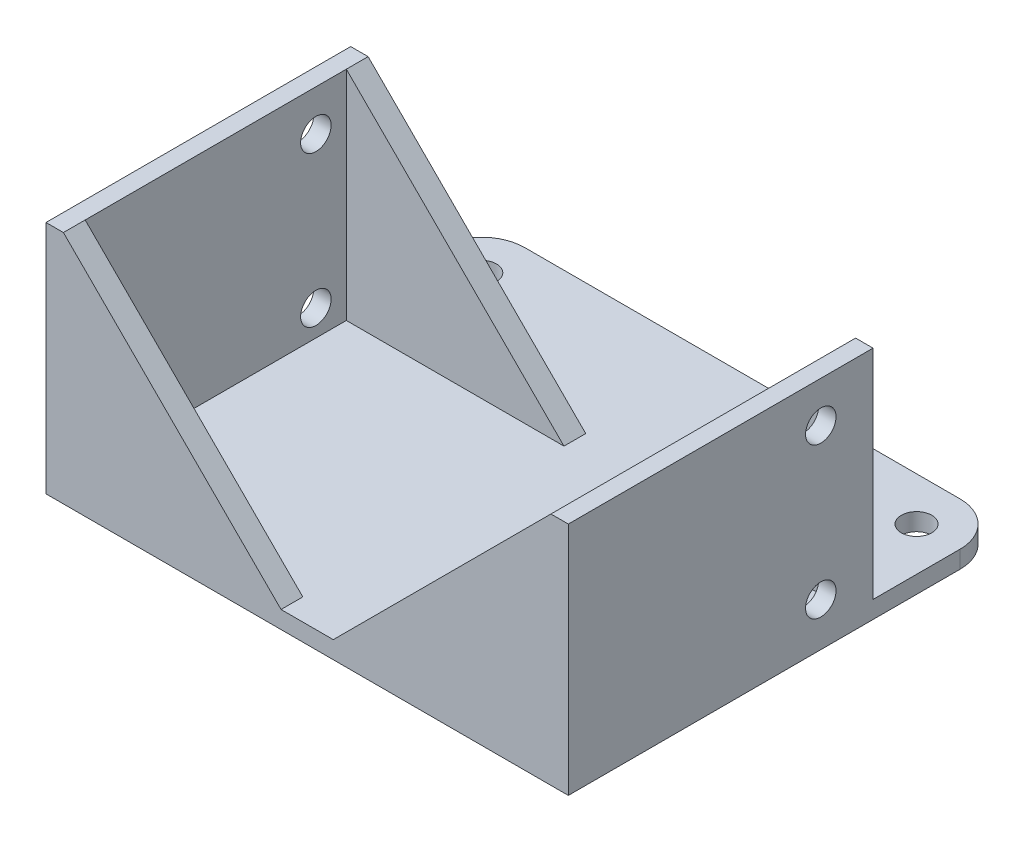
from build123d import *

# Parameters (mm, degrees)
SKETCH1_W               = 60
SKETCH1_H               = 50
BOSS_EXTRUDE1_DEPTH     = 2
SKETCH2_W               = 2
SKETCH2_H               = 35
BOSS_EXTRUDE2_DEPTH     = 25
BOSS_EXTRUDE3_DEPTH     = 35
SKETCH5_W               = 56
SKETCH5_H               = 30
CUT_EXTRUDE1_DEPTH      = 31
CUT_EXTRUDE2_DEPTH      = 71.384657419
CUT_EXTRUDE2_DEPTH_BACK = 71.384657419
SKETCH3_R               = 1.75
FILLET1_R               = 5
CUT_EXTRUDE3_DEPTH      = 48.476309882
CUT_EXTRUDE3_DEPTH_BACK = 48.476309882
SKETCH6_R               = 1.75


with BuildPart() as part:
    # Sketch1 → Boss-Extrude1 (new body)
    with BuildSketch(Plane(origin=(0, 0, 0), x_dir=(1, 0, 0), z_dir=(0, 1, 0))):
        Rectangle(SKETCH1_W, SKETCH1_H)
    extrude(amount=BOSS_EXTRUDE1_DEPTH)

    # Sketch2 → Boss-Extrude2 (add)
    with BuildSketch(Plane(origin=(0, 2, 0), x_dir=(1, 0, 0), z_dir=(0, 1, 0))):
        with Locations((-29, -7.5)):
            Rectangle(SKETCH2_W, SKETCH2_H)
        with Locations((29, -7.5)):
            Rectangle(SKETCH2_W, SKETCH2_H)
    extrude(amount=BOSS_EXTRUDE2_DEPTH)

    # Sketch4 → Boss-Extrude3 (add)
    with BuildSketch(Plane.XY.offset(25)):
        Polygon((-28, 27), (-3, 2), (-3, 0), (-30, 0), (-30, 27), align=None)
        Polygon((28, 27), (3, 2), (3, 0), (30, 0), (30, 27), align=None)
    extrude(amount=-BOSS_EXTRUDE3_DEPTH)

    # Sketch5 → Cut-Extrude1 (cut)
    with BuildSketch(Plane(origin=(0, 2, 0), x_dir=(1, 0, 0), z_dir=(0, 1, 0))):
        with Locations((0, -7.5)):
            Rectangle(SKETCH5_W, SKETCH5_H)
    extrude(amount=CUT_EXTRUDE1_DEPTH, mode=Mode.SUBTRACT)

    # Sketch3 → Cut-Extrude2 (cut, two sides: drawn at the far end of the back side and taken through both)
    with BuildSketch(Plane.ZY.offset(30).offset(-CUT_EXTRUDE2_DEPTH_BACK)):
        with Locations((-4, 22.3)):
            Circle(SKETCH3_R)
        with Locations((-4, 5)):
            Circle(SKETCH3_R)
    extrude(amount=CUT_EXTRUDE2_DEPTH + CUT_EXTRUDE2_DEPTH_BACK, mode=Mode.SUBTRACT)

    # Fillet1
    fillet1_edges = [part.edges().sort_by_distance(p)[0] for p in [
        (-30, 1, -25),
        (30, 1, -25),
    ]]
    fillet(fillet1_edges, radius=FILLET1_R)

    # Sketch6 → Cut-Extrude3 (cut, two sides: drawn at the far end of the back side and taken through both)
    with BuildSketch(Plane.XZ.offset(-CUT_EXTRUDE3_DEPTH_BACK)):
        with Locations(Location((-25, 20, 0), (0, 0, 270))):
            Circle(SKETCH6_R)
        with Locations(Location((25, 20, 0), (0, 0, 270))):
            Circle(SKETCH6_R)
        with Locations(Location((25, -20, 0), (0, 0, 270))):
            Circle(SKETCH6_R)
        with Locations(Location((-25, -20, 0), (0, 0, 270))):
            Circle(SKETCH6_R)
    extrude(amount=CUT_EXTRUDE3_DEPTH + CUT_EXTRUDE3_DEPTH_BACK, mode=Mode.SUBTRACT)


solid = part.part
